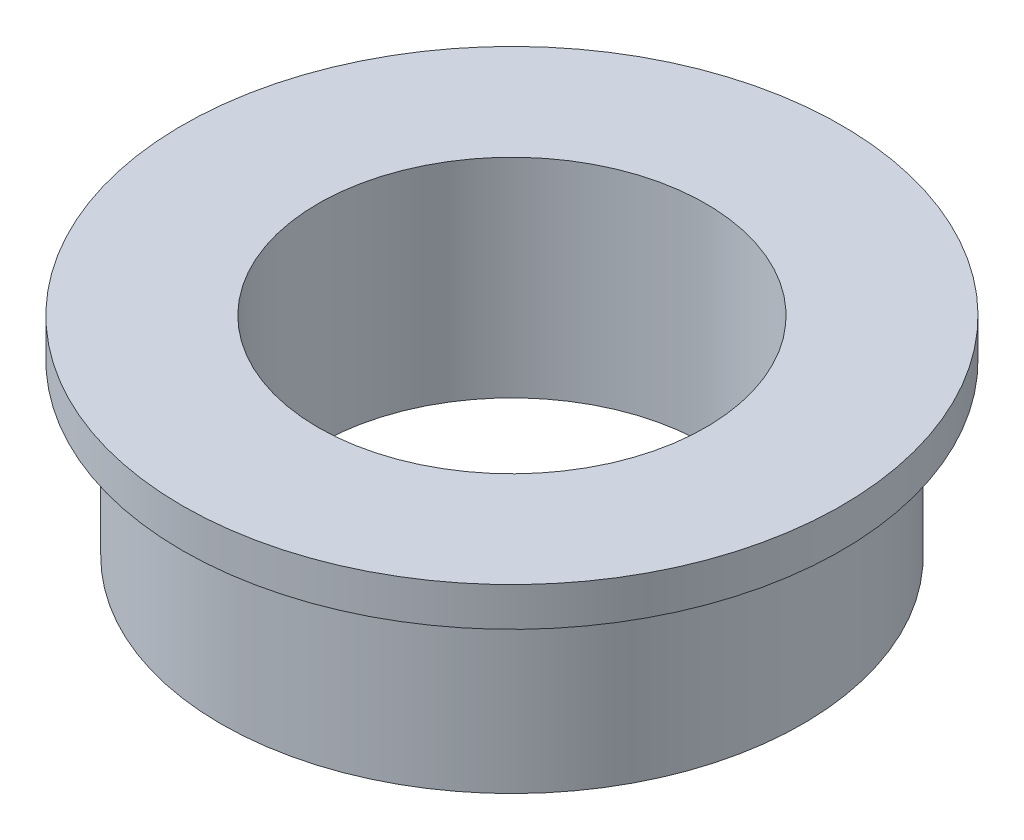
ISO-10303-21;
HEADER;
FILE_DESCRIPTION(('STEP AP214'),'2;1');
FILE_NAME('part.step','',(''),(''),'','','');
FILE_SCHEMA(('AUTOMOTIVE_DESIGN { 1 0 10303 214 1 1 1 1 }'));
ENDSEC;
DATA;
#1=APPLICATION_CONTEXT('core data for automotive mechanical design processes');
#2=APPLICATION_PROTOCOL_DEFINITION('international standard','automotive_design',2000,#1);
#3=PRODUCT_CONTEXT('',#1,'mechanical');
#4=PRODUCT('Part','Part','',(#3));
#5=PRODUCT_RELATED_PRODUCT_CATEGORY('part','',(#4));
#6=PRODUCT_DEFINITION_FORMATION('','',#4);
#7=PRODUCT_DEFINITION_CONTEXT('part definition',#1,'design');
#8=PRODUCT_DEFINITION('design','',#6,#7);
#9=PRODUCT_DEFINITION_SHAPE('','',#8);
#10=(LENGTH_UNIT() NAMED_UNIT(*) SI_UNIT(.MILLI.,.METRE.));
#11=(NAMED_UNIT(*) PLANE_ANGLE_UNIT() SI_UNIT($,.RADIAN.));
#12=(NAMED_UNIT(*) SI_UNIT($,.STERADIAN.) SOLID_ANGLE_UNIT());
#13=UNCERTAINTY_MEASURE_WITH_UNIT(LENGTH_MEASURE(1.E-05),#10,'distance_accuracy_value','');
#14=(GEOMETRIC_REPRESENTATION_CONTEXT(3) GLOBAL_UNCERTAINTY_ASSIGNED_CONTEXT((#13)) GLOBAL_UNIT_ASSIGNED_CONTEXT((#10,
#11,#12)) REPRESENTATION_CONTEXT('',''));
#15=CARTESIAN_POINT('',(0.,0.,0.));
#16=DIRECTION('',(0.,0.,1.));
#17=DIRECTION('',(1.,0.,0.));
#18=AXIS2_PLACEMENT_3D('',#15,#16,#17);
#19=CARTESIAN_POINT('',(0.,0.,0.));
#20=DIRECTION('',(0.,1.,0.));
#21=DIRECTION('',(0.,0.,1.));
#22=AXIS2_PLACEMENT_3D('',#19,#20,#21);
#23=PLANE('',#22);
#24=CARTESIAN_POINT('',(0.,0.,0.));
#25=DIRECTION('',(0.,1.,0.));
#26=DIRECTION('',(0.,0.,1.));
#27=AXIS2_PLACEMENT_3D('',#24,#25,#26);
#28=CIRCLE('',#27,6.);
#29=CARTESIAN_POINT('',(0.,0.,6.));
#30=VERTEX_POINT('',#29);
#31=EDGE_CURVE('E36',#30,#30,#28,.T.);
#32=ORIENTED_EDGE('',*,*,#31,.F.);
#33=EDGE_LOOP('',(#32));
#34=FACE_BOUND('',#33,.T.);
#35=CARTESIAN_POINT('',(0.,0.,0.));
#36=DIRECTION('',(0.,1.,0.));
#37=DIRECTION('',(0.,0.,1.));
#38=AXIS2_PLACEMENT_3D('',#35,#36,#37);
#39=CIRCLE('',#38,4.);
#40=CARTESIAN_POINT('',(0.,0.,4.));
#41=VERTEX_POINT('',#40);
#42=EDGE_CURVE('E43',#41,#41,#39,.T.);
#43=ORIENTED_EDGE('',*,*,#42,.T.);
#44=EDGE_LOOP('',(#43));
#45=FACE_BOUND('',#44,.T.);
#46=ADVANCED_FACE('F32',(#34,#45),#23,.F.);
#47=CARTESIAN_POINT('',(0.,3.5,0.));
#48=DIRECTION('',(0.,-1.,0.));
#49=DIRECTION('',(0.,0.,-1.));
#50=AXIS2_PLACEMENT_3D('',#47,#48,#49);
#51=CYLINDRICAL_SURFACE('',#50,6.);
#52=CARTESIAN_POINT('',(0.,3.5,0.));
#53=DIRECTION('',(0.,1.,0.));
#54=DIRECTION('',(0.,0.,1.));
#55=AXIS2_PLACEMENT_3D('',#52,#53,#54);
#56=CIRCLE('',#55,6.);
#57=CARTESIAN_POINT('',(0.,3.5,6.));
#58=VERTEX_POINT('',#57);
#59=EDGE_CURVE('E10',#58,#58,#56,.T.);
#60=ORIENTED_EDGE('',*,*,#59,.F.);
#61=EDGE_LOOP('',(#60));
#62=FACE_BOUND('',#61,.T.);
#63=ORIENTED_EDGE('',*,*,#31,.T.);
#64=EDGE_LOOP('',(#63));
#65=FACE_BOUND('',#64,.T.);
#66=ADVANCED_FACE('F34',(#62,#65),#51,.T.);
#67=CARTESIAN_POINT('',(0.,3.5,0.));
#68=DIRECTION('',(0.,-1.,0.));
#69=DIRECTION('',(0.,0.,-1.));
#70=AXIS2_PLACEMENT_3D('',#67,#68,#69);
#71=CYLINDRICAL_SURFACE('',#70,4.);
#72=ORIENTED_EDGE('',*,*,#42,.F.);
#73=EDGE_LOOP('',(#72));
#74=FACE_BOUND('',#73,.T.);
#75=CARTESIAN_POINT('',(0.,4.3,0.));
#76=DIRECTION('',(0.,1.,0.));
#77=DIRECTION('',(0.,0.,1.));
#78=AXIS2_PLACEMENT_3D('',#75,#76,#77);
#79=CIRCLE('',#78,4.);
#80=CARTESIAN_POINT('',(0.,4.3,4.));
#81=VERTEX_POINT('',#80);
#82=EDGE_CURVE('E51',#81,#81,#79,.T.);
#83=ORIENTED_EDGE('',*,*,#82,.T.);
#84=EDGE_LOOP('',(#83));
#85=FACE_BOUND('',#84,.T.);
#86=ADVANCED_FACE('F57',(#74,#85),#71,.F.);
#87=CARTESIAN_POINT('',(0.,3.5,0.));
#88=DIRECTION('',(0.,1.,0.));
#89=DIRECTION('',(0.,0.,1.));
#90=AXIS2_PLACEMENT_3D('',#87,#88,#89);
#91=PLANE('',#90);
#92=CARTESIAN_POINT('',(0.,3.5,0.));
#93=DIRECTION('',(0.,1.,0.));
#94=DIRECTION('',(0.,0.,1.));
#95=AXIS2_PLACEMENT_3D('',#92,#93,#94);
#96=CIRCLE('',#95,6.8);
#97=CARTESIAN_POINT('',(0.,3.5,6.8));
#98=VERTEX_POINT('',#97);
#99=EDGE_CURVE('E48',#98,#98,#96,.T.);
#100=ORIENTED_EDGE('',*,*,#99,.F.);
#101=EDGE_LOOP('',(#100));
#102=FACE_BOUND('',#101,.T.);
#103=ORIENTED_EDGE('',*,*,#59,.T.);
#104=EDGE_LOOP('',(#103));
#105=FACE_BOUND('',#104,.T.);
#106=ADVANCED_FACE('F62',(#102,#105),#91,.F.);
#107=CARTESIAN_POINT('',(0.,4.3,0.));
#108=DIRECTION('',(0.,1.,0.));
#109=DIRECTION('',(0.,0.,1.));
#110=AXIS2_PLACEMENT_3D('',#107,#108,#109);
#111=PLANE('',#110);
#112=CARTESIAN_POINT('',(0.,4.3,0.));
#113=DIRECTION('',(0.,1.,0.));
#114=DIRECTION('',(0.,0.,1.));
#115=AXIS2_PLACEMENT_3D('',#112,#113,#114);
#116=CIRCLE('',#115,6.8);
#117=CARTESIAN_POINT('',(0.,4.3,6.8));
#118=VERTEX_POINT('',#117);
#119=EDGE_CURVE('E47',#118,#118,#116,.T.);
#120=ORIENTED_EDGE('',*,*,#119,.T.);
#121=EDGE_LOOP('',(#120));
#122=FACE_BOUND('',#121,.T.);
#123=ORIENTED_EDGE('',*,*,#82,.F.);
#124=EDGE_LOOP('',(#123));
#125=FACE_BOUND('',#124,.T.);
#126=ADVANCED_FACE('F59',(#122,#125),#111,.T.);
#127=CARTESIAN_POINT('',(0.,4.3,0.));
#128=DIRECTION('',(0.,-1.,0.));
#129=DIRECTION('',(0.,0.,-1.));
#130=AXIS2_PLACEMENT_3D('',#127,#128,#129);
#131=CYLINDRICAL_SURFACE('',#130,6.8);
#132=ORIENTED_EDGE('',*,*,#119,.F.);
#133=EDGE_LOOP('',(#132));
#134=FACE_BOUND('',#133,.T.);
#135=ORIENTED_EDGE('',*,*,#99,.T.);
#136=EDGE_LOOP('',(#135));
#137=FACE_BOUND('',#136,.T.);
#138=ADVANCED_FACE('F61',(#134,#137),#131,.T.);
#139=CLOSED_SHELL('',(#46,#66,#86,#106,#126,#138));
#140=MANIFOLD_SOLID_BREP('B2',#139);
#141=ADVANCED_BREP_SHAPE_REPRESENTATION('',(#18,#140),#14);
#142=SHAPE_DEFINITION_REPRESENTATION(#9,#141);
ENDSEC;
END-ISO-10303-21;
